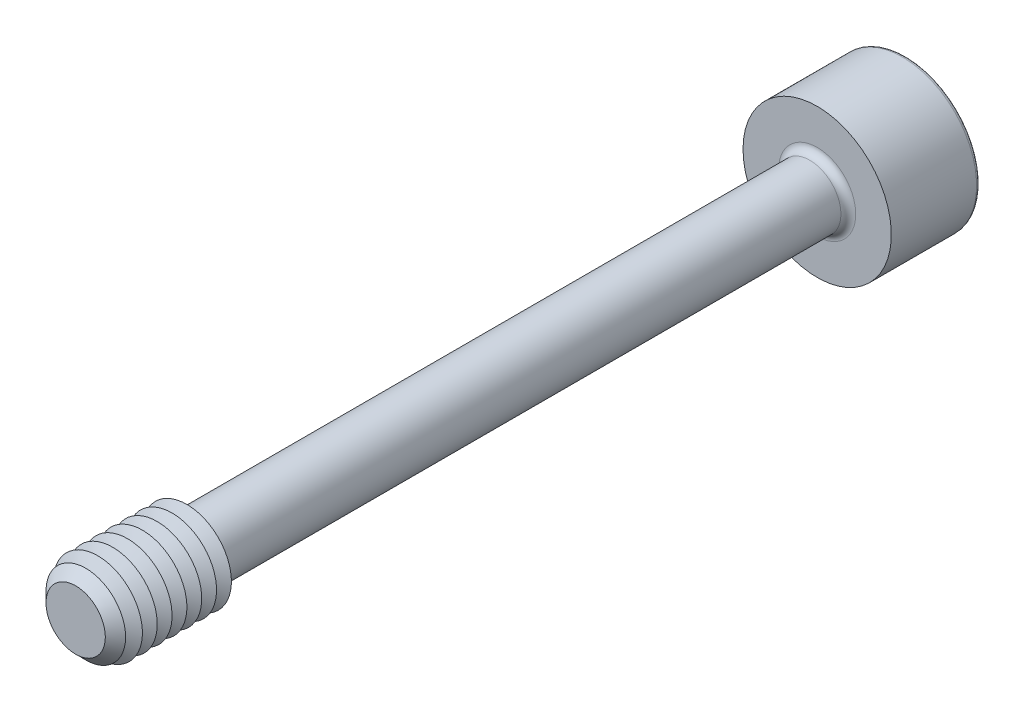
from build123d import *

# Parameters (mm, degrees)
SKETCH1_R       = 2.1
EXTRUDE1_DEPTH  = 25
CHAMFER1_SIZE   = 1
SKETCH3_R       = 5
EXTRUDE2_DEPTH  = 6
EXTRUDE3_DEPTH  = 5
FILLET1_R       = 0.5
FILLET2_R       = 0.25
LPATTERN1_COUNT = 7
LPATTERN1_PITCH = 1


with BuildPart() as part:
    # Sketch1 → Extrude1 (new, symmetric)
    with BuildSketch(Plane.XY):
        Circle(SKETCH1_R)
    extrude(amount=EXTRUDE1_DEPTH, both=True)

    # Sketch2 → Revolve1 (revolve)
    with BuildSketch(Plane(origin=(0, 0, 0), x_dir=(0, 0, -1), z_dir=(1, 0, 0))):
        Polygon((-25, 0), (-25, 3), (-17.5, 3), (-16.980384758, 2.1), (-16.980384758, 0), align=None)
    revolve(axis=Axis((0, 0, 16.980384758), (0, 0, 1)))

    # Chamfer1
    chamfer1_edges = [part.edges().sort_by_distance(p)[0] for p in [
        (0, -3, 25),
    ]]
    chamfer(chamfer1_edges, length=CHAMFER1_SIZE)

    # Sketch3 → Extrude2 (add)
    with BuildSketch(Plane(origin=(0, 0, -25), x_dir=(-1, 0, 0), z_dir=(0, 0, -1))):
        Circle(SKETCH3_R)
    extrude(amount=EXTRUDE2_DEPTH)

    # Sketch4 → Extrude3 (cut)
    with BuildSketch(Plane(origin=(-13.7, 0, -31), x_dir=(1, 0, 0), z_dir=(0, 0, 1))):
        Polygon((12.256624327, -2.5), (15.143375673, -2.5), (16.586751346, 0), (15.143375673, 2.5), (12.256624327, 2.5), (10.813248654, 0), align=None)
    extrude(amount=EXTRUDE3_DEPTH, mode=Mode.SUBTRACT)

    # Fillet1
    fillet1_edges = [part.edges().sort_by_distance(p)[0] for p in [
        (-2.1, 0, -25),
    ]]
    fillet(fillet1_edges, radius=FILLET1_R)

    # Fillet2
    fillet2_edges = [part.edges().sort_by_distance(p)[0] for p in [
        (5, 0, -31),
    ]]
    fillet(fillet2_edges, radius=FILLET2_R)

    # Sketch5 → Cut-Revolve1 (revolve, cut)
    with BuildSketch(Plane(origin=(0, 0, 0), x_dir=(0, 0, -1), z_dir=(1, 0, 0)), mode=Mode.PRIVATE) as cut_revolve1_sk:
        Polygon((26, 0), (26, -2.5), (24.556624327, 0), align=None)
    revolve(cut_revolve1_sk.sketch.rotate(Axis((0, 0, -24.556624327), (0, 0, -1)), 90), axis=Axis((0, 0, -24.556624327), (0, 0, -1)), mode=Mode.SUBTRACT)

    # Sketch7 → Cut-Revolve2 (revolve, cut)
    with BuildSketch(Plane(origin=(0, 0, 0), x_dir=(0, 0, -1), z_dir=(1, 0, 0)), mode=Mode.PRIVATE) as cut_revolve2_sk:
        Polygon((-17.5, 3), (-18, 2.133974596), (-18.5, 3), align=None)
    cut_revolve2 = revolve(cut_revolve2_sk.sketch.rotate(Axis((0, 0, -1.332048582), (0, 0, 1)), 90), axis=Axis((0, 0, -1.332048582), (0, 0, 1)), mode=Mode.SUBTRACT)

    # LPattern1: Cut-Revolve2 ×7
    with Locations(*[(0, 0, i * LPATTERN1_PITCH) for i in range(1, LPATTERN1_COUNT)]):
        add(cut_revolve2, mode=Mode.SUBTRACT)


solid = part.part
